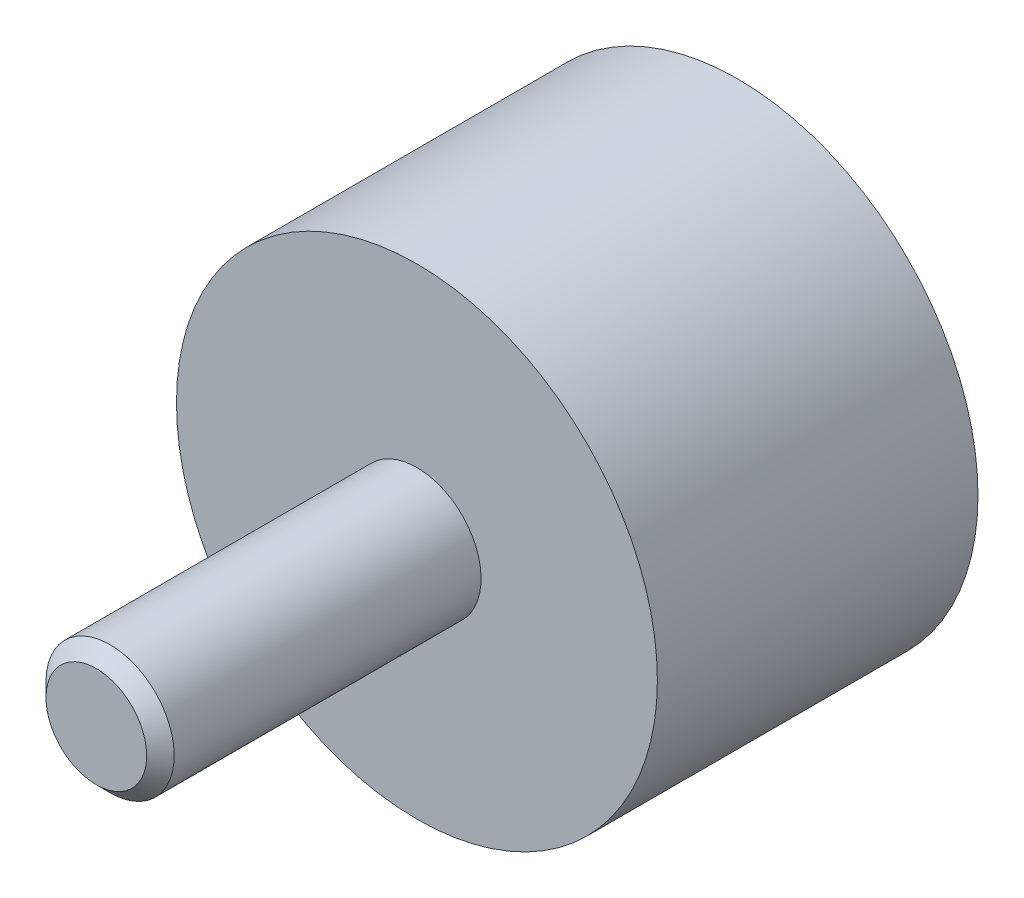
ISO-10303-21;
HEADER;
FILE_DESCRIPTION(('STEP AP214'),'2;1');
FILE_NAME('part.step','',(''),(''),'','','');
FILE_SCHEMA(('AUTOMOTIVE_DESIGN { 1 0 10303 214 1 1 1 1 }'));
ENDSEC;
DATA;
#1=APPLICATION_CONTEXT('core data for automotive mechanical design processes');
#2=APPLICATION_PROTOCOL_DEFINITION('international standard','automotive_design',2000,#1);
#3=PRODUCT_CONTEXT('',#1,'mechanical');
#4=PRODUCT('Part','Part','',(#3));
#5=PRODUCT_RELATED_PRODUCT_CATEGORY('part','',(#4));
#6=PRODUCT_DEFINITION_FORMATION('','',#4);
#7=PRODUCT_DEFINITION_CONTEXT('part definition',#1,'design');
#8=PRODUCT_DEFINITION('design','',#6,#7);
#9=PRODUCT_DEFINITION_SHAPE('','',#8);
#10=(LENGTH_UNIT() NAMED_UNIT(*) SI_UNIT(.MILLI.,.METRE.));
#11=(NAMED_UNIT(*) PLANE_ANGLE_UNIT() SI_UNIT($,.RADIAN.));
#12=(NAMED_UNIT(*) SI_UNIT($,.STERADIAN.) SOLID_ANGLE_UNIT());
#13=UNCERTAINTY_MEASURE_WITH_UNIT(LENGTH_MEASURE(1.E-05),#10,'distance_accuracy_value','');
#14=(GEOMETRIC_REPRESENTATION_CONTEXT(3) GLOBAL_UNCERTAINTY_ASSIGNED_CONTEXT((#13)) GLOBAL_UNIT_ASSIGNED_CONTEXT((#10,
#11,#12)) REPRESENTATION_CONTEXT('',''));
#15=CARTESIAN_POINT('',(0.,0.,0.));
#16=DIRECTION('',(0.,0.,1.));
#17=DIRECTION('',(1.,0.,0.));
#18=AXIS2_PLACEMENT_3D('',#15,#16,#17);
#19=CARTESIAN_POINT('',(7.,0.,10.));
#20=DIRECTION('',(0.,0.,1.));
#21=DIRECTION('',(0.,-1.,0.));
#22=AXIS2_PLACEMENT_3D('',#19,#20,#21);
#23=PLANE('',#22);
#24=CARTESIAN_POINT('',(0.,0.,10.));
#25=DIRECTION('',(0.,0.,1.));
#26=DIRECTION('',(0.,-1.,0.));
#27=AXIS2_PLACEMENT_3D('',#24,#25,#26);
#28=CIRCLE('',#27,2.);
#29=CARTESIAN_POINT('',(0.,-2.,10.));
#30=VERTEX_POINT('',#29);
#31=EDGE_CURVE('E23',#30,#30,#28,.T.);
#32=ORIENTED_EDGE('',*,*,#31,.F.);
#33=EDGE_LOOP('',(#32));
#34=FACE_BOUND('',#33,.T.);
#35=CARTESIAN_POINT('',(0.,0.,10.));
#36=DIRECTION('',(0.,0.,1.));
#37=DIRECTION('',(0.,-1.,0.));
#38=AXIS2_PLACEMENT_3D('',#35,#36,#37);
#39=CIRCLE('',#38,7.5);
#40=CARTESIAN_POINT('',(0.,-7.5,10.));
#41=VERTEX_POINT('',#40);
#42=EDGE_CURVE('E27',#41,#41,#39,.T.);
#43=ORIENTED_EDGE('',*,*,#42,.T.);
#44=EDGE_LOOP('',(#43));
#45=FACE_BOUND('',#44,.T.);
#46=ADVANCED_FACE('F12',(#34,#45),#23,.T.);
#47=CARTESIAN_POINT('',(0.,0.,0.33333333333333));
#48=DIRECTION('',(0.,0.,1.));
#49=DIRECTION('',(0.,-1.,0.));
#50=AXIS2_PLACEMENT_3D('',#47,#48,#49);
#51=CYLINDRICAL_SURFACE('',#50,7.5);
#52=CARTESIAN_POINT('',(0.,0.,0.));
#53=DIRECTION('',(0.,0.,1.));
#54=DIRECTION('',(0.,-1.,0.));
#55=AXIS2_PLACEMENT_3D('',#52,#53,#54);
#56=CIRCLE('',#55,7.5);
#57=CARTESIAN_POINT('',(0.,-7.5,0.));
#58=VERTEX_POINT('',#57);
#59=EDGE_CURVE('E32',#58,#58,#56,.T.);
#60=ORIENTED_EDGE('',*,*,#59,.T.);
#61=EDGE_LOOP('',(#60));
#62=FACE_BOUND('',#61,.T.);
#63=ORIENTED_EDGE('',*,*,#42,.F.);
#64=EDGE_LOOP('',(#63));
#65=FACE_BOUND('',#64,.T.);
#66=ADVANCED_FACE('F63',(#62,#65),#51,.T.);
#67=CARTESIAN_POINT('',(7.5,0.,0.));
#68=DIRECTION('',(0.,0.,-1.));
#69=DIRECTION('',(0.,1.,0.));
#70=AXIS2_PLACEMENT_3D('',#67,#68,#69);
#71=PLANE('',#70);
#72=CARTESIAN_POINT('',(0.,0.,0.));
#73=DIRECTION('',(0.,0.,-1.));
#74=DIRECTION('',(0.,1.,0.));
#75=AXIS2_PLACEMENT_3D('',#72,#73,#74);
#76=CIRCLE('',#75,2.4);
#77=CARTESIAN_POINT('',(0.,2.4,0.));
#78=VERTEX_POINT('',#77);
#79=EDGE_CURVE('E8',#78,#78,#76,.F.);
#80=ORIENTED_EDGE('',*,*,#79,.T.);
#81=EDGE_LOOP('',(#80));
#82=FACE_BOUND('',#81,.T.);
#83=ORIENTED_EDGE('',*,*,#59,.F.);
#84=EDGE_LOOP('',(#83));
#85=FACE_BOUND('',#84,.T.);
#86=ADVANCED_FACE('F68',(#82,#85),#71,.T.);
#87=CARTESIAN_POINT('',(0.,0.,20.));
#88=DIRECTION('',(0.,0.,1.));
#89=DIRECTION('',(0.,-1.,0.));
#90=AXIS2_PLACEMENT_3D('',#87,#88,#89);
#91=PLANE('',#90);
#92=CARTESIAN_POINT('',(0.,0.,20.));
#93=DIRECTION('',(0.,0.,1.));
#94=DIRECTION('',(0.,-1.,0.));
#95=AXIS2_PLACEMENT_3D('',#92,#93,#94);
#96=CIRCLE('',#95,1.5705);
#97=CARTESIAN_POINT('',(0.,-1.5705,20.));
#98=VERTEX_POINT('',#97);
#99=EDGE_CURVE('E35',#98,#98,#96,.T.);
#100=ORIENTED_EDGE('',*,*,#99,.T.);
#101=EDGE_LOOP('',(#100));
#102=FACE_BOUND('',#101,.T.);
#103=ADVANCED_FACE('F74',(#102),#91,.T.);
#104=CARTESIAN_POINT('',(0.,0.,20.));
#105=DIRECTION('',(0.,0.,-1.));
#106=DIRECTION('',(0.,1.,0.));
#107=AXIS2_PLACEMENT_3D('',#104,#105,#106);
#108=CONICAL_SURFACE('',#107,1.5705,0.785398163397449);
#109=CARTESIAN_POINT('',(0.,0.,19.5705));
#110=DIRECTION('',(0.,0.,1.));
#111=DIRECTION('',(0.,-1.,0.));
#112=AXIS2_PLACEMENT_3D('',#109,#110,#111);
#113=CIRCLE('',#112,2.);
#114=CARTESIAN_POINT('',(0.,-2.,19.5705));
#115=VERTEX_POINT('',#114);
#116=EDGE_CURVE('E38',#115,#115,#113,.T.);
#117=ORIENTED_EDGE('',*,*,#116,.T.);
#118=EDGE_LOOP('',(#117));
#119=FACE_BOUND('',#118,.T.);
#120=ORIENTED_EDGE('',*,*,#99,.F.);
#121=EDGE_LOOP('',(#120));
#122=FACE_BOUND('',#121,.T.);
#123=ADVANCED_FACE('F57',(#119,#122),#108,.T.);
#124=CARTESIAN_POINT('',(0.,0.,10.));
#125=DIRECTION('',(0.,0.,1.));
#126=DIRECTION('',(0.,-1.,0.));
#127=AXIS2_PLACEMENT_3D('',#124,#125,#126);
#128=CYLINDRICAL_SURFACE('',#127,2.);
#129=ORIENTED_EDGE('',*,*,#31,.T.);
#130=EDGE_LOOP('',(#129));
#131=FACE_BOUND('',#130,.T.);
#132=ORIENTED_EDGE('',*,*,#116,.F.);
#133=EDGE_LOOP('',(#132));
#134=FACE_BOUND('',#133,.T.);
#135=ADVANCED_FACE('F49',(#131,#134),#128,.T.);
#136=CARTESIAN_POINT('',(0.,0.,0.));
#137=DIRECTION('',(0.,0.,1.));
#138=DIRECTION('',(0.,-1.,0.));
#139=AXIS2_PLACEMENT_3D('',#136,#137,#138);
#140=CYLINDRICAL_SURFACE('',#139,2.);
#141=CARTESIAN_POINT('',(0.,0.,0.399999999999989));
#142=DIRECTION('',(0.,0.,-1.));
#143=DIRECTION('',(0.,1.,0.));
#144=AXIS2_PLACEMENT_3D('',#141,#142,#143);
#145=CIRCLE('',#144,2.);
#146=CARTESIAN_POINT('',(0.,2.,0.399999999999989));
#147=VERTEX_POINT('',#146);
#148=EDGE_CURVE('E19',#147,#147,#145,.T.);
#149=ORIENTED_EDGE('',*,*,#148,.T.);
#150=EDGE_LOOP('',(#149));
#151=FACE_BOUND('',#150,.T.);
#152=CARTESIAN_POINT('',(0.,0.,4.));
#153=DIRECTION('',(0.,0.,-1.));
#154=DIRECTION('',(0.,1.,0.));
#155=AXIS2_PLACEMENT_3D('',#152,#153,#154);
#156=CIRCLE('',#155,2.);
#157=CARTESIAN_POINT('',(0.,2.,4.));
#158=VERTEX_POINT('',#157);
#159=EDGE_CURVE('E41',#158,#158,#156,.T.);
#160=ORIENTED_EDGE('',*,*,#159,.F.);
#161=EDGE_LOOP('',(#160));
#162=FACE_BOUND('',#161,.T.);
#163=ADVANCED_FACE('F47',(#151,#162),#140,.F.);
#164=CARTESIAN_POINT('',(0.,0.,4.));
#165=DIRECTION('',(0.,0.,-1.));
#166=DIRECTION('',(0.,1.,0.));
#167=AXIS2_PLACEMENT_3D('',#164,#165,#166);
#168=PLANE('',#167);
#169=ORIENTED_EDGE('',*,*,#159,.T.);
#170=EDGE_LOOP('',(#169));
#171=FACE_BOUND('',#170,.T.);
#172=ADVANCED_FACE('F45',(#171),#168,.T.);
#173=CARTESIAN_POINT('',(0.,0.,0.399999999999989));
#174=DIRECTION('',(0.,0.,-1.));
#175=DIRECTION('',(0.,1.,0.));
#176=AXIS2_PLACEMENT_3D('',#173,#174,#175);
#177=CONICAL_SURFACE('',#176,2.,0.785398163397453);
#178=ORIENTED_EDGE('',*,*,#79,.F.);
#179=EDGE_LOOP('',(#178));
#180=FACE_BOUND('',#179,.T.);
#181=ORIENTED_EDGE('',*,*,#148,.F.);
#182=EDGE_LOOP('',(#181));
#183=FACE_BOUND('',#182,.T.);
#184=ADVANCED_FACE('F14',(#180,#183),#177,.F.);
#185=CLOSED_SHELL('',(#46,#66,#86,#103,#123,#135,#163,#172,#184));
#186=MANIFOLD_SOLID_BREP('B1',#185);
#187=ADVANCED_BREP_SHAPE_REPRESENTATION('',(#18,#186),#14);
#188=SHAPE_DEFINITION_REPRESENTATION(#9,#187);
ENDSEC;
END-ISO-10303-21;
